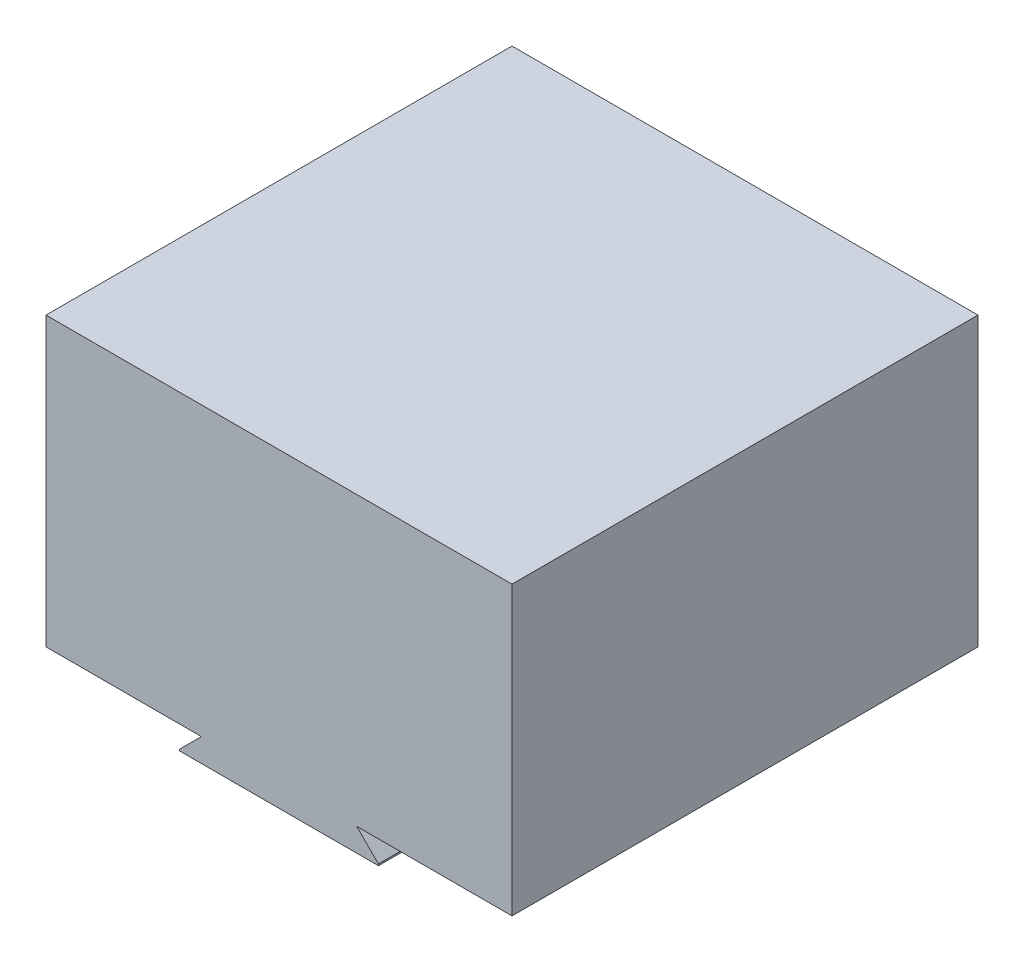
ISO-10303-21;
HEADER;
FILE_DESCRIPTION(('STEP AP214'),'2;1');
FILE_NAME('part.step','',(''),(''),'','','');
FILE_SCHEMA(('AUTOMOTIVE_DESIGN { 1 0 10303 214 1 1 1 1 }'));
ENDSEC;
DATA;
#1=APPLICATION_CONTEXT('core data for automotive mechanical design processes');
#2=APPLICATION_PROTOCOL_DEFINITION('international standard','automotive_design',2000,#1);
#3=PRODUCT_CONTEXT('',#1,'mechanical');
#4=PRODUCT('Part','Part','',(#3));
#5=PRODUCT_RELATED_PRODUCT_CATEGORY('part','',(#4));
#6=PRODUCT_DEFINITION_FORMATION('','',#4);
#7=PRODUCT_DEFINITION_CONTEXT('part definition',#1,'design');
#8=PRODUCT_DEFINITION('design','',#6,#7);
#9=PRODUCT_DEFINITION_SHAPE('','',#8);
#10=(LENGTH_UNIT() NAMED_UNIT(*) SI_UNIT(.MILLI.,.METRE.));
#11=(NAMED_UNIT(*) PLANE_ANGLE_UNIT() SI_UNIT($,.RADIAN.));
#12=(NAMED_UNIT(*) SI_UNIT($,.STERADIAN.) SOLID_ANGLE_UNIT());
#13=UNCERTAINTY_MEASURE_WITH_UNIT(LENGTH_MEASURE(1.E-05),#10,'distance_accuracy_value','');
#14=(GEOMETRIC_REPRESENTATION_CONTEXT(3) GLOBAL_UNCERTAINTY_ASSIGNED_CONTEXT((#13)) GLOBAL_UNIT_ASSIGNED_CONTEXT((#10,
#11,#12)) REPRESENTATION_CONTEXT('',''));
#15=CARTESIAN_POINT('',(0.,0.,0.));
#16=DIRECTION('',(0.,0.,1.));
#17=DIRECTION('',(1.,0.,0.));
#18=AXIS2_PLACEMENT_3D('',#15,#16,#17);
#19=CARTESIAN_POINT('',(-16.256,-25.146,-38.1));
#20=DIRECTION('',(0.707106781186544,-0.707106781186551,0.));
#21=DIRECTION('',(0.707106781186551,0.707106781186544,0.));
#22=AXIS2_PLACEMENT_3D('',#19,#20,#21);
#23=PLANE('',#22);
#24=DIRECTION('',(0.,0.,1.));
#25=VECTOR('',#24,1.);
#26=CARTESIAN_POINT('',(-16.256,-25.146,-38.1));
#27=LINE('',#26,#25);
#28=CARTESIAN_POINT('',(-16.256,-25.146,-38.1));
#29=VERTEX_POINT('',#28);
#30=CARTESIAN_POINT('',(-16.256,-25.146,-19.0627));
#31=VERTEX_POINT('',#30);
#32=EDGE_CURVE('E193',#29,#31,#27,.T.);
#33=ORIENTED_EDGE('',*,*,#32,.T.);
#34=DIRECTION('',(0.707106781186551,0.707106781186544,0.));
#35=VECTOR('',#34,1.);
#36=CARTESIAN_POINT('',(-16.256,-25.146,-19.0627));
#37=LINE('',#36,#35);
#38=CARTESIAN_POINT('',(-12.7,-21.59,-19.0627));
#39=VERTEX_POINT('',#38);
#40=EDGE_CURVE('E170',#31,#39,#37,.T.);
#41=ORIENTED_EDGE('',*,*,#40,.T.);
#42=DIRECTION('',(0.,0.,1.));
#43=VECTOR('',#42,1.);
#44=CARTESIAN_POINT('',(-12.7,-21.59,-38.1));
#45=LINE('',#44,#43);
#46=CARTESIAN_POINT('',(-12.7,-21.59,-38.1));
#47=VERTEX_POINT('',#46);
#48=EDGE_CURVE('E147',#47,#39,#45,.T.);
#49=ORIENTED_EDGE('',*,*,#48,.F.);
#50=DIRECTION('',(0.707106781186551,0.707106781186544,0.));
#51=VECTOR('',#50,1.);
#52=CARTESIAN_POINT('',(-16.256,-25.146,-38.1));
#53=LINE('',#52,#51);
#54=EDGE_CURVE('E181',#29,#47,#53,.T.);
#55=ORIENTED_EDGE('',*,*,#54,.F.);
#56=EDGE_LOOP('',(#33,#41,#49,#55));
#57=FACE_BOUND('',#56,.T.);
#58=ADVANCED_FACE('F33',(#57),#23,.F.);
#59=CARTESIAN_POINT('',(-16.256,-25.146,-38.1));
#60=DIRECTION('',(1.,0.,0.));
#61=DIRECTION('',(0.,0.,-1.));
#62=AXIS2_PLACEMENT_3D('',#59,#60,#61);
#63=PLANE('',#62);
#64=DIRECTION('',(0.,0.,1.));
#65=VECTOR('',#64,1.);
#66=CARTESIAN_POINT('',(-16.256,-25.4,-38.1));
#67=LINE('',#66,#65);
#68=CARTESIAN_POINT('',(-16.256,-25.4,-38.1));
#69=VERTEX_POINT('',#68);
#70=CARTESIAN_POINT('',(-16.256,-25.4,-19.0627));
#71=VERTEX_POINT('',#70);
#72=EDGE_CURVE('E197',#69,#71,#67,.T.);
#73=ORIENTED_EDGE('',*,*,#72,.T.);
#74=DIRECTION('',(0.,1.,0.));
#75=VECTOR('',#74,1.);
#76=CARTESIAN_POINT('',(-16.256,-25.146,-19.0627));
#77=LINE('',#76,#75);
#78=EDGE_CURVE('E12',#71,#31,#77,.T.);
#79=ORIENTED_EDGE('',*,*,#78,.T.);
#80=ORIENTED_EDGE('',*,*,#32,.F.);
#81=DIRECTION('',(0.,1.,0.));
#82=VECTOR('',#81,1.);
#83=CARTESIAN_POINT('',(-16.256,-25.146,-38.1));
#84=LINE('',#83,#82);
#85=EDGE_CURVE('E177',#69,#29,#84,.T.);
#86=ORIENTED_EDGE('',*,*,#85,.F.);
#87=EDGE_LOOP('',(#73,#79,#80,#86));
#88=FACE_BOUND('',#87,.T.);
#89=ADVANCED_FACE('F291',(#88),#63,.F.);
#90=CARTESIAN_POINT('',(38.1,-25.4,-38.1));
#91=DIRECTION('',(1.,0.,0.));
#92=DIRECTION('',(0.,0.,-1.));
#93=AXIS2_PLACEMENT_3D('',#90,#91,#92);
#94=PLANE('',#93);
#95=DIRECTION('',(0.,0.,1.));
#96=VECTOR('',#95,1.);
#97=CARTESIAN_POINT('',(38.1,-21.59,-38.1));
#98=LINE('',#97,#96);
#99=CARTESIAN_POINT('',(38.1,-21.59,-38.1));
#100=VERTEX_POINT('',#99);
#101=CARTESIAN_POINT('',(38.1,-21.59,38.1));
#102=VERTEX_POINT('',#101);
#103=EDGE_CURVE('E225',#100,#102,#98,.T.);
#104=ORIENTED_EDGE('',*,*,#103,.F.);
#105=DIRECTION('',(0.,1.,0.));
#106=VECTOR('',#105,1.);
#107=CARTESIAN_POINT('',(38.1,-25.4,-38.1));
#108=LINE('',#107,#106);
#109=CARTESIAN_POINT('',(38.1,25.4,-38.1));
#110=VERTEX_POINT('',#109);
#111=EDGE_CURVE('E238',#100,#110,#108,.T.);
#112=ORIENTED_EDGE('',*,*,#111,.T.);
#113=DIRECTION('',(0.,0.,1.));
#114=VECTOR('',#113,1.);
#115=CARTESIAN_POINT('',(38.1,25.4,-38.1));
#116=LINE('',#115,#114);
#117=CARTESIAN_POINT('',(38.1,25.4,38.1));
#118=VERTEX_POINT('',#117);
#119=EDGE_CURVE('E248',#110,#118,#116,.T.);
#120=ORIENTED_EDGE('',*,*,#119,.T.);
#121=DIRECTION('',(0.,1.,0.));
#122=VECTOR('',#121,1.);
#123=CARTESIAN_POINT('',(38.1,-25.4,38.1));
#124=LINE('',#123,#122);
#125=EDGE_CURVE('E222',#102,#118,#124,.T.);
#126=ORIENTED_EDGE('',*,*,#125,.F.);
#127=EDGE_LOOP('',(#104,#112,#120,#126));
#128=FACE_BOUND('',#127,.T.);
#129=ADVANCED_FACE('F35',(#128),#94,.T.);
#130=CARTESIAN_POINT('',(-38.1,-25.4,-38.1));
#131=DIRECTION('',(0.,-1.,0.));
#132=DIRECTION('',(0.,0.,-1.));
#133=AXIS2_PLACEMENT_3D('',#130,#131,#132);
#134=PLANE('',#133);
#135=DIRECTION('',(1.,0.,0.));
#136=VECTOR('',#135,1.);
#137=CARTESIAN_POINT('',(-16.51,-25.4,-19.0627));
#138=LINE('',#137,#136);
#139=CARTESIAN_POINT('',(-9.906,-25.4,-19.0627));
#140=VERTEX_POINT('',#139);
#141=EDGE_CURVE('E163',#71,#140,#138,.T.);
#142=ORIENTED_EDGE('',*,*,#141,.F.);
#143=ORIENTED_EDGE('',*,*,#72,.F.);
#144=DIRECTION('',(1.,0.,0.));
#145=VECTOR('',#144,1.);
#146=CARTESIAN_POINT('',(-38.1,-25.4,-38.1));
#147=LINE('',#146,#145);
#148=CARTESIAN_POINT('',(16.256,-25.4,-38.1));
#149=VERTEX_POINT('',#148);
#150=EDGE_CURVE('E246',#69,#149,#147,.T.);
#151=ORIENTED_EDGE('',*,*,#150,.T.);
#152=DIRECTION('',(0.,0.,1.));
#153=VECTOR('',#152,1.);
#154=CARTESIAN_POINT('',(16.256,-25.4,-38.1));
#155=LINE('',#154,#153);
#156=CARTESIAN_POINT('',(16.256,-25.4,38.1));
#157=VERTEX_POINT('',#156);
#158=EDGE_CURVE('E212',#149,#157,#155,.T.);
#159=ORIENTED_EDGE('',*,*,#158,.T.);
#160=DIRECTION('',(1.,0.,0.));
#161=VECTOR('',#160,1.);
#162=CARTESIAN_POINT('',(-38.1,-25.4,38.1));
#163=LINE('',#162,#161);
#164=CARTESIAN_POINT('',(-16.256,-25.4,38.1));
#165=VERTEX_POINT('',#164);
#166=EDGE_CURVE('E236',#165,#157,#163,.T.);
#167=ORIENTED_EDGE('',*,*,#166,.F.);
#168=CARTESIAN_POINT('',(-16.256,-25.4,-12.6873));
#169=VERTEX_POINT('',#168);
#170=EDGE_CURVE('E55',#169,#165,#67,.T.);
#171=ORIENTED_EDGE('',*,*,#170,.F.);
#172=DIRECTION('',(-1.,0.,0.));
#173=VECTOR('',#172,1.);
#174=CARTESIAN_POINT('',(-16.51,-25.4,-12.6873));
#175=LINE('',#174,#173);
#176=CARTESIAN_POINT('',(-9.906,-25.4,-12.6873));
#177=VERTEX_POINT('',#176);
#178=EDGE_CURVE('E48',#177,#169,#175,.T.);
#179=ORIENTED_EDGE('',*,*,#178,.F.);
#180=CARTESIAN_POINT('',(-9.906,-25.4,-15.875));
#181=DIRECTION('',(0.,-1.,0.));
#182=DIRECTION('',(0.,0.,-1.));
#183=AXIS2_PLACEMENT_3D('',#180,#181,#182);
#184=CIRCLE('',#183,3.1877);
#185=EDGE_CURVE('E320',#140,#177,#184,.T.);
#186=ORIENTED_EDGE('',*,*,#185,.F.);
#187=EDGE_LOOP('',(#142,#143,#151,#159,#167,#171,#179,#186));
#188=FACE_BOUND('',#187,.T.);
#189=ADVANCED_FACE('F256',(#188),#134,.T.);
#190=CARTESIAN_POINT('',(-38.1,-25.4,-38.1));
#191=DIRECTION('',(-1.,0.,0.));
#192=DIRECTION('',(0.,0.,1.));
#193=AXIS2_PLACEMENT_3D('',#190,#191,#192);
#194=PLANE('',#193);
#195=DIRECTION('',(0.,0.,1.));
#196=VECTOR('',#195,1.);
#197=CARTESIAN_POINT('',(-38.1,-21.59,-38.1));
#198=LINE('',#197,#196);
#199=CARTESIAN_POINT('',(-38.1,-21.59,-38.1));
#200=VERTEX_POINT('',#199);
#201=CARTESIAN_POINT('',(-38.1,-21.59,38.1));
#202=VERTEX_POINT('',#201);
#203=EDGE_CURVE('E184',#200,#202,#198,.T.);
#204=ORIENTED_EDGE('',*,*,#203,.T.);
#205=DIRECTION('',(0.,-1.,0.));
#206=VECTOR('',#205,1.);
#207=CARTESIAN_POINT('',(-38.1,-25.4,38.1));
#208=LINE('',#207,#206);
#209=CARTESIAN_POINT('',(-38.1,25.4,38.1));
#210=VERTEX_POINT('',#209);
#211=EDGE_CURVE('E233',#210,#202,#208,.T.);
#212=ORIENTED_EDGE('',*,*,#211,.F.);
#213=DIRECTION('',(0.,0.,1.));
#214=VECTOR('',#213,1.);
#215=CARTESIAN_POINT('',(-38.1,25.4,-38.1));
#216=LINE('',#215,#214);
#217=CARTESIAN_POINT('',(-38.1,25.4,-38.1));
#218=VERTEX_POINT('',#217);
#219=EDGE_CURVE('E249',#218,#210,#216,.T.);
#220=ORIENTED_EDGE('',*,*,#219,.F.);
#221=DIRECTION('',(0.,-1.,0.));
#222=VECTOR('',#221,1.);
#223=CARTESIAN_POINT('',(-38.1,-25.4,-38.1));
#224=LINE('',#223,#222);
#225=EDGE_CURVE('E243',#218,#200,#224,.T.);
#226=ORIENTED_EDGE('',*,*,#225,.T.);
#227=EDGE_LOOP('',(#204,#212,#220,#226));
#228=FACE_BOUND('',#227,.T.);
#229=ADVANCED_FACE('F283',(#228),#194,.T.);
#230=CARTESIAN_POINT('',(-38.1,25.4,-38.1));
#231=DIRECTION('',(0.,1.,0.));
#232=DIRECTION('',(0.,0.,1.));
#233=AXIS2_PLACEMENT_3D('',#230,#231,#232);
#234=PLANE('',#233);
#235=ORIENTED_EDGE('',*,*,#219,.T.);
#236=DIRECTION('',(-1.,0.,0.));
#237=VECTOR('',#236,1.);
#238=CARTESIAN_POINT('',(-38.1,25.4,38.1));
#239=LINE('',#238,#237);
#240=EDGE_CURVE('E230',#118,#210,#239,.T.);
#241=ORIENTED_EDGE('',*,*,#240,.F.);
#242=ORIENTED_EDGE('',*,*,#119,.F.);
#243=DIRECTION('',(-1.,0.,0.));
#244=VECTOR('',#243,1.);
#245=CARTESIAN_POINT('',(-38.1,25.4,-38.1));
#246=LINE('',#245,#244);
#247=EDGE_CURVE('E240',#110,#218,#246,.T.);
#248=ORIENTED_EDGE('',*,*,#247,.T.);
#249=EDGE_LOOP('',(#235,#241,#242,#248));
#250=FACE_BOUND('',#249,.T.);
#251=ADVANCED_FACE('F279',(#250),#234,.T.);
#252=CARTESIAN_POINT('',(38.1,25.4,-38.1));
#253=DIRECTION('',(0.,0.,-1.));
#254=DIRECTION('',(-1.,0.,0.));
#255=AXIS2_PLACEMENT_3D('',#252,#253,#254);
#256=PLANE('',#255);
#257=DIRECTION('',(-1.,0.,0.));
#258=VECTOR('',#257,1.);
#259=CARTESIAN_POINT('',(-12.7,-21.59,-38.1));
#260=LINE('',#259,#258);
#261=EDGE_CURVE('E174',#47,#200,#260,.T.);
#262=ORIENTED_EDGE('',*,*,#261,.T.);
#263=ORIENTED_EDGE('',*,*,#225,.F.);
#264=ORIENTED_EDGE('',*,*,#247,.F.);
#265=ORIENTED_EDGE('',*,*,#111,.F.);
#266=DIRECTION('',(-1.,0.,0.));
#267=VECTOR('',#266,1.);
#268=CARTESIAN_POINT('',(12.7,-21.59,-38.1));
#269=LINE('',#268,#267);
#270=CARTESIAN_POINT('',(12.7,-21.59,-38.1));
#271=VERTEX_POINT('',#270);
#272=EDGE_CURVE('E205',#100,#271,#269,.T.);
#273=ORIENTED_EDGE('',*,*,#272,.T.);
#274=DIRECTION('',(0.707106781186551,-0.707106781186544,0.));
#275=VECTOR('',#274,1.);
#276=CARTESIAN_POINT('',(16.256,-25.146,-38.1));
#277=LINE('',#276,#275);
#278=CARTESIAN_POINT('',(16.256,-25.146,-38.1));
#279=VERTEX_POINT('',#278);
#280=EDGE_CURVE('E209',#271,#279,#277,.T.);
#281=ORIENTED_EDGE('',*,*,#280,.T.);
#282=DIRECTION('',(0.,-1.,0.));
#283=VECTOR('',#282,1.);
#284=CARTESIAN_POINT('',(16.256,-25.146,-38.1));
#285=LINE('',#284,#283);
#286=EDGE_CURVE('E202',#279,#149,#285,.T.);
#287=ORIENTED_EDGE('',*,*,#286,.T.);
#288=ORIENTED_EDGE('',*,*,#150,.F.);
#289=ORIENTED_EDGE('',*,*,#85,.T.);
#290=ORIENTED_EDGE('',*,*,#54,.T.);
#291=EDGE_LOOP('',(#262,#263,#264,#265,#273,#281,#287,#288,#289,#290));
#292=FACE_BOUND('',#291,.T.);
#293=ADVANCED_FACE('F286',(#292),#256,.T.);
#294=CARTESIAN_POINT('',(38.1,25.4,38.1));
#295=DIRECTION('',(0.,0.,-1.));
#296=DIRECTION('',(-1.,0.,0.));
#297=AXIS2_PLACEMENT_3D('',#294,#295,#296);
#298=PLANE('',#297);
#299=ORIENTED_EDGE('',*,*,#211,.T.);
#300=DIRECTION('',(-1.,0.,0.));
#301=VECTOR('',#300,1.);
#302=CARTESIAN_POINT('',(-12.7,-21.59,38.1));
#303=LINE('',#302,#301);
#304=CARTESIAN_POINT('',(-12.7,-21.59,38.1));
#305=VERTEX_POINT('',#304);
#306=EDGE_CURVE('E173',#305,#202,#303,.T.);
#307=ORIENTED_EDGE('',*,*,#306,.F.);
#308=DIRECTION('',(0.707106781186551,0.707106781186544,0.));
#309=VECTOR('',#308,1.);
#310=CARTESIAN_POINT('',(-16.256,-25.146,38.1));
#311=LINE('',#310,#309);
#312=CARTESIAN_POINT('',(-16.256,-25.146,38.1));
#313=VERTEX_POINT('',#312);
#314=EDGE_CURVE('E178',#313,#305,#311,.T.);
#315=ORIENTED_EDGE('',*,*,#314,.F.);
#316=DIRECTION('',(0.,1.,0.));
#317=VECTOR('',#316,1.);
#318=CARTESIAN_POINT('',(-16.256,-25.146,38.1));
#319=LINE('',#318,#317);
#320=EDGE_CURVE('E186',#165,#313,#319,.T.);
#321=ORIENTED_EDGE('',*,*,#320,.F.);
#322=ORIENTED_EDGE('',*,*,#166,.T.);
#323=DIRECTION('',(0.,-1.,0.));
#324=VECTOR('',#323,1.);
#325=CARTESIAN_POINT('',(16.256,-25.146,38.1));
#326=LINE('',#325,#324);
#327=CARTESIAN_POINT('',(16.256,-25.146,38.1));
#328=VERTEX_POINT('',#327);
#329=EDGE_CURVE('E191',#328,#157,#326,.T.);
#330=ORIENTED_EDGE('',*,*,#329,.F.);
#331=DIRECTION('',(0.707106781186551,-0.707106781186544,0.));
#332=VECTOR('',#331,1.);
#333=CARTESIAN_POINT('',(16.256,-25.146,38.1));
#334=LINE('',#333,#332);
#335=CARTESIAN_POINT('',(12.7,-21.59,38.1));
#336=VERTEX_POINT('',#335);
#337=EDGE_CURVE('E206',#336,#328,#334,.T.);
#338=ORIENTED_EDGE('',*,*,#337,.F.);
#339=DIRECTION('',(-1.,0.,0.));
#340=VECTOR('',#339,1.);
#341=CARTESIAN_POINT('',(12.7,-21.59,38.1));
#342=LINE('',#341,#340);
#343=EDGE_CURVE('E215',#102,#336,#342,.T.);
#344=ORIENTED_EDGE('',*,*,#343,.F.);
#345=ORIENTED_EDGE('',*,*,#125,.T.);
#346=ORIENTED_EDGE('',*,*,#240,.T.);
#347=EDGE_LOOP('',(#299,#307,#315,#321,#322,#330,#338,#344,#345,#346));
#348=FACE_BOUND('',#347,.T.);
#349=ADVANCED_FACE('F260',(#348),#298,.F.);
#350=CARTESIAN_POINT('',(16.256,-25.146,-38.1));
#351=DIRECTION('',(-1.,0.,0.));
#352=DIRECTION('',(0.,0.,1.));
#353=AXIS2_PLACEMENT_3D('',#350,#351,#352);
#354=PLANE('',#353);
#355=ORIENTED_EDGE('',*,*,#329,.T.);
#356=ORIENTED_EDGE('',*,*,#158,.F.);
#357=ORIENTED_EDGE('',*,*,#286,.F.);
#358=DIRECTION('',(0.,0.,1.));
#359=VECTOR('',#358,1.);
#360=CARTESIAN_POINT('',(16.256,-25.146,-38.1));
#361=LINE('',#360,#359);
#362=EDGE_CURVE('E220',#279,#328,#361,.T.);
#363=ORIENTED_EDGE('',*,*,#362,.T.);
#364=EDGE_LOOP('',(#355,#356,#357,#363));
#365=FACE_BOUND('',#364,.T.);
#366=ADVANCED_FACE('F264',(#365),#354,.F.);
#367=CARTESIAN_POINT('',(16.256,-25.146,-38.1));
#368=DIRECTION('',(-0.707106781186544,-0.707106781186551,0.));
#369=DIRECTION('',(0.707106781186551,-0.707106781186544,0.));
#370=AXIS2_PLACEMENT_3D('',#367,#368,#369);
#371=PLANE('',#370);
#372=ORIENTED_EDGE('',*,*,#337,.T.);
#373=ORIENTED_EDGE('',*,*,#362,.F.);
#374=ORIENTED_EDGE('',*,*,#280,.F.);
#375=DIRECTION('',(0.,0.,1.));
#376=VECTOR('',#375,1.);
#377=CARTESIAN_POINT('',(12.7,-21.59,-38.1));
#378=LINE('',#377,#376);
#379=EDGE_CURVE('E223',#271,#336,#378,.T.);
#380=ORIENTED_EDGE('',*,*,#379,.T.);
#381=EDGE_LOOP('',(#372,#373,#374,#380));
#382=FACE_BOUND('',#381,.T.);
#383=ADVANCED_FACE('F268',(#382),#371,.F.);
#384=CARTESIAN_POINT('',(12.7,-21.59,-38.1));
#385=DIRECTION('',(0.,1.,0.));
#386=DIRECTION('',(-1.,0.,0.));
#387=AXIS2_PLACEMENT_3D('',#384,#385,#386);
#388=PLANE('',#387);
#389=ORIENTED_EDGE('',*,*,#343,.T.);
#390=ORIENTED_EDGE('',*,*,#379,.F.);
#391=ORIENTED_EDGE('',*,*,#272,.F.);
#392=ORIENTED_EDGE('',*,*,#103,.T.);
#393=EDGE_LOOP('',(#389,#390,#391,#392));
#394=FACE_BOUND('',#393,.T.);
#395=ADVANCED_FACE('F293',(#394),#388,.F.);
#396=CARTESIAN_POINT('',(-12.7,-21.59,-38.1));
#397=DIRECTION('',(0.,1.,0.));
#398=DIRECTION('',(-1.,0.,0.));
#399=AXIS2_PLACEMENT_3D('',#396,#397,#398);
#400=PLANE('',#399);
#401=DIRECTION('',(-1.,0.,0.));
#402=VECTOR('',#401,1.);
#403=CARTESIAN_POINT('',(-16.51,-21.59,-12.6873));
#404=LINE('',#403,#402);
#405=CARTESIAN_POINT('',(-9.906,-21.59,-12.6873));
#406=VERTEX_POINT('',#405);
#407=CARTESIAN_POINT('',(-12.7,-21.59,-12.6873));
#408=VERTEX_POINT('',#407);
#409=EDGE_CURVE('E171',#406,#408,#404,.T.);
#410=ORIENTED_EDGE('',*,*,#409,.T.);
#411=EDGE_CURVE('E192',#408,#305,#45,.T.);
#412=ORIENTED_EDGE('',*,*,#411,.T.);
#413=ORIENTED_EDGE('',*,*,#306,.T.);
#414=ORIENTED_EDGE('',*,*,#203,.F.);
#415=ORIENTED_EDGE('',*,*,#261,.F.);
#416=ORIENTED_EDGE('',*,*,#48,.T.);
#417=DIRECTION('',(1.,0.,0.));
#418=VECTOR('',#417,1.);
#419=CARTESIAN_POINT('',(-16.51,-21.59,-19.0627));
#420=LINE('',#419,#418);
#421=CARTESIAN_POINT('',(-9.906,-21.59,-19.0627));
#422=VERTEX_POINT('',#421);
#423=EDGE_CURVE('E141',#39,#422,#420,.T.);
#424=ORIENTED_EDGE('',*,*,#423,.T.);
#425=CARTESIAN_POINT('',(-9.906,-21.59,-15.875));
#426=DIRECTION('',(0.,1.,0.));
#427=DIRECTION('',(-1.,0.,0.));
#428=AXIS2_PLACEMENT_3D('',#425,#426,#427);
#429=CIRCLE('',#428,3.1877);
#430=EDGE_CURVE('E145',#422,#406,#429,.F.);
#431=ORIENTED_EDGE('',*,*,#430,.T.);
#432=EDGE_LOOP('',(#410,#412,#413,#414,#415,#416,#424,#431));
#433=FACE_BOUND('',#432,.T.);
#434=ADVANCED_FACE('F144',(#433),#400,.F.);
#435=ORIENTED_EDGE('',*,*,#411,.F.);
#436=DIRECTION('',(-0.707106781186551,-0.707106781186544,0.));
#437=VECTOR('',#436,1.);
#438=CARTESIAN_POINT('',(-16.256,-25.146,-12.6873));
#439=LINE('',#438,#437);
#440=CARTESIAN_POINT('',(-16.256,-25.146,-12.6873));
#441=VERTEX_POINT('',#440);
#442=EDGE_CURVE('E167',#408,#441,#439,.T.);
#443=ORIENTED_EDGE('',*,*,#442,.T.);
#444=EDGE_CURVE('E196',#441,#313,#27,.T.);
#445=ORIENTED_EDGE('',*,*,#444,.T.);
#446=ORIENTED_EDGE('',*,*,#314,.T.);
#447=EDGE_LOOP('',(#435,#443,#445,#446));
#448=FACE_BOUND('',#447,.T.);
#449=ADVANCED_FACE('F300',(#448),#23,.F.);
#450=ORIENTED_EDGE('',*,*,#444,.F.);
#451=DIRECTION('',(0.,-1.,0.));
#452=VECTOR('',#451,1.);
#453=CARTESIAN_POINT('',(-16.256,-25.146,-12.6873));
#454=LINE('',#453,#452);
#455=EDGE_CURVE('E41',#441,#169,#454,.T.);
#456=ORIENTED_EDGE('',*,*,#455,.T.);
#457=ORIENTED_EDGE('',*,*,#170,.T.);
#458=ORIENTED_EDGE('',*,*,#320,.T.);
#459=EDGE_LOOP('',(#450,#456,#457,#458));
#460=FACE_BOUND('',#459,.T.);
#461=ADVANCED_FACE('F253',(#460),#63,.F.);
#462=CARTESIAN_POINT('',(-16.51,-7.12934477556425,-19.0627));
#463=DIRECTION('',(0.,0.,-1.));
#464=DIRECTION('',(-1.,0.,0.));
#465=AXIS2_PLACEMENT_3D('',#462,#463,#464);
#466=PLANE('',#465);
#467=ORIENTED_EDGE('',*,*,#78,.F.);
#468=ORIENTED_EDGE('',*,*,#141,.T.);
#469=DIRECTION('',(0.,-1.,0.));
#470=VECTOR('',#469,1.);
#471=CARTESIAN_POINT('',(-9.906,-7.12934477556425,-19.0627));
#472=LINE('',#471,#470);
#473=EDGE_CURVE('E151',#422,#140,#472,.T.);
#474=ORIENTED_EDGE('',*,*,#473,.F.);
#475=ORIENTED_EDGE('',*,*,#423,.F.);
#476=ORIENTED_EDGE('',*,*,#40,.F.);
#477=EDGE_LOOP('',(#467,#468,#474,#475,#476));
#478=FACE_BOUND('',#477,.T.);
#479=ADVANCED_FACE('F161',(#478),#466,.F.);
#480=CARTESIAN_POINT('',(-16.51,-7.12934477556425,-12.6873));
#481=DIRECTION('',(0.,0.,1.));
#482=DIRECTION('',(1.,0.,0.));
#483=AXIS2_PLACEMENT_3D('',#480,#481,#482);
#484=PLANE('',#483);
#485=ORIENTED_EDGE('',*,*,#409,.F.);
#486=DIRECTION('',(0.,-1.,0.));
#487=VECTOR('',#486,1.);
#488=CARTESIAN_POINT('',(-9.906,-7.12934477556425,-12.6873));
#489=LINE('',#488,#487);
#490=EDGE_CURVE('E159',#406,#177,#489,.T.);
#491=ORIENTED_EDGE('',*,*,#490,.T.);
#492=ORIENTED_EDGE('',*,*,#178,.T.);
#493=ORIENTED_EDGE('',*,*,#455,.F.);
#494=ORIENTED_EDGE('',*,*,#442,.F.);
#495=EDGE_LOOP('',(#485,#491,#492,#493,#494));
#496=FACE_BOUND('',#495,.T.);
#497=ADVANCED_FACE('F322',(#496),#484,.F.);
#498=CARTESIAN_POINT('',(-9.906,-7.12934477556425,-15.875));
#499=DIRECTION('',(0.,-1.,0.));
#500=DIRECTION('',(0.,0.,-1.));
#501=AXIS2_PLACEMENT_3D('',#498,#499,#500);
#502=CYLINDRICAL_SURFACE('',#501,3.1877);
#503=ORIENTED_EDGE('',*,*,#473,.T.);
#504=ORIENTED_EDGE('',*,*,#185,.T.);
#505=ORIENTED_EDGE('',*,*,#490,.F.);
#506=ORIENTED_EDGE('',*,*,#430,.F.);
#507=EDGE_LOOP('',(#503,#504,#505,#506));
#508=FACE_BOUND('',#507,.T.);
#509=ADVANCED_FACE('F156',(#508),#502,.F.);
#510=CLOSED_SHELL('',(#58,#89,#129,#189,#229,#251,#293,#349,#366,#383,#395,#434,#449,#461,#479,
#497,#509));
#511=MANIFOLD_SOLID_BREP('B2',#510);
#512=ADVANCED_BREP_SHAPE_REPRESENTATION('',(#18,#511),#14);
#513=SHAPE_DEFINITION_REPRESENTATION(#9,#512);
ENDSEC;
END-ISO-10303-21;
